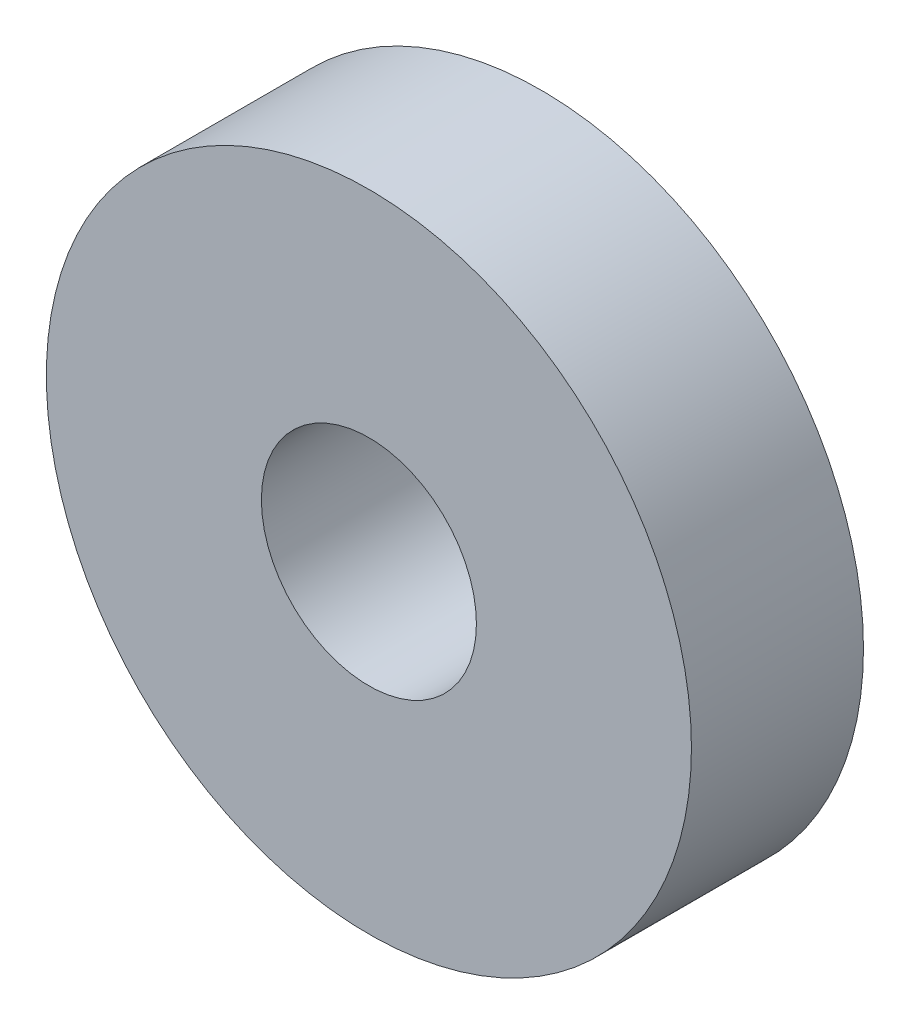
ISO-10303-21;
HEADER;
FILE_DESCRIPTION(('STEP AP214'),'2;1');
FILE_NAME('part.step','',(''),(''),'','','');
FILE_SCHEMA(('AUTOMOTIVE_DESIGN { 1 0 10303 214 1 1 1 1 }'));
ENDSEC;
DATA;
#1=APPLICATION_CONTEXT('core data for automotive mechanical design processes');
#2=APPLICATION_PROTOCOL_DEFINITION('international standard','automotive_design',2000,#1);
#3=PRODUCT_CONTEXT('',#1,'mechanical');
#4=PRODUCT('Part','Part','',(#3));
#5=PRODUCT_RELATED_PRODUCT_CATEGORY('part','',(#4));
#6=PRODUCT_DEFINITION_FORMATION('','',#4);
#7=PRODUCT_DEFINITION_CONTEXT('part definition',#1,'design');
#8=PRODUCT_DEFINITION('design','',#6,#7);
#9=PRODUCT_DEFINITION_SHAPE('','',#8);
#10=(LENGTH_UNIT() NAMED_UNIT(*) SI_UNIT(.MILLI.,.METRE.));
#11=(NAMED_UNIT(*) PLANE_ANGLE_UNIT() SI_UNIT($,.RADIAN.));
#12=(NAMED_UNIT(*) SI_UNIT($,.STERADIAN.) SOLID_ANGLE_UNIT());
#13=UNCERTAINTY_MEASURE_WITH_UNIT(LENGTH_MEASURE(1.E-05),#10,'distance_accuracy_value','');
#14=(GEOMETRIC_REPRESENTATION_CONTEXT(3) GLOBAL_UNCERTAINTY_ASSIGNED_CONTEXT((#13)) GLOBAL_UNIT_ASSIGNED_CONTEXT((#10,
#11,#12)) REPRESENTATION_CONTEXT('',''));
#15=CARTESIAN_POINT('',(0.,0.,0.));
#16=DIRECTION('',(0.,0.,1.));
#17=DIRECTION('',(1.,0.,0.));
#18=AXIS2_PLACEMENT_3D('',#15,#16,#17);
#19=CARTESIAN_POINT('',(0.,0.,0.));
#20=DIRECTION('',(0.,0.,-1.));
#21=DIRECTION('',(-1.,0.,0.));
#22=AXIS2_PLACEMENT_3D('',#19,#20,#21);
#23=PLANE('',#22);
#24=CARTESIAN_POINT('',(0.,0.,0.));
#25=DIRECTION('',(0.,0.,1.));
#26=DIRECTION('',(1.,0.,0.));
#27=AXIS2_PLACEMENT_3D('',#24,#25,#26);
#28=CIRCLE('',#27,15.);
#29=CARTESIAN_POINT('',(15.,0.,0.));
#30=VERTEX_POINT('',#29);
#31=EDGE_CURVE('E27',#30,#30,#28,.T.);
#32=ORIENTED_EDGE('',*,*,#31,.F.);
#33=EDGE_LOOP('',(#32));
#34=FACE_BOUND('',#33,.T.);
#35=CARTESIAN_POINT('',(0.,0.,0.));
#36=DIRECTION('',(0.,0.,1.));
#37=DIRECTION('',(1.,0.,0.));
#38=AXIS2_PLACEMENT_3D('',#35,#36,#37);
#39=CIRCLE('',#38,5.);
#40=CARTESIAN_POINT('',(5.,0.,0.));
#41=VERTEX_POINT('',#40);
#42=EDGE_CURVE('E18',#41,#41,#39,.T.);
#43=ORIENTED_EDGE('',*,*,#42,.T.);
#44=EDGE_LOOP('',(#43));
#45=FACE_BOUND('',#44,.T.);
#46=ADVANCED_FACE('F14',(#34,#45),#23,.T.);
#47=CARTESIAN_POINT('',(0.,0.,0.));
#48=DIRECTION('',(0.,0.,1.));
#49=DIRECTION('',(1.,0.,0.));
#50=AXIS2_PLACEMENT_3D('',#47,#48,#49);
#51=CYLINDRICAL_SURFACE('',#50,5.);
#52=CARTESIAN_POINT('',(0.,0.,8.));
#53=DIRECTION('',(0.,0.,1.));
#54=DIRECTION('',(1.,0.,0.));
#55=AXIS2_PLACEMENT_3D('',#52,#53,#54);
#56=CIRCLE('',#55,5.);
#57=CARTESIAN_POINT('',(5.,0.,8.));
#58=VERTEX_POINT('',#57);
#59=EDGE_CURVE('E22',#58,#58,#56,.T.);
#60=ORIENTED_EDGE('',*,*,#59,.T.);
#61=EDGE_LOOP('',(#60));
#62=FACE_BOUND('',#61,.T.);
#63=ORIENTED_EDGE('',*,*,#42,.F.);
#64=EDGE_LOOP('',(#63));
#65=FACE_BOUND('',#64,.T.);
#66=ADVANCED_FACE('F36',(#62,#65),#51,.F.);
#67=CARTESIAN_POINT('',(0.,0.,0.));
#68=DIRECTION('',(0.,0.,1.));
#69=DIRECTION('',(1.,0.,0.));
#70=AXIS2_PLACEMENT_3D('',#67,#68,#69);
#71=CYLINDRICAL_SURFACE('',#70,15.);
#72=ORIENTED_EDGE('',*,*,#31,.T.);
#73=EDGE_LOOP('',(#72));
#74=FACE_BOUND('',#73,.T.);
#75=CARTESIAN_POINT('',(0.,0.,8.));
#76=DIRECTION('',(0.,0.,1.));
#77=DIRECTION('',(1.,0.,0.));
#78=AXIS2_PLACEMENT_3D('',#75,#76,#77);
#79=CIRCLE('',#78,15.);
#80=CARTESIAN_POINT('',(15.,0.,8.));
#81=VERTEX_POINT('',#80);
#82=EDGE_CURVE('E9',#81,#81,#79,.F.);
#83=ORIENTED_EDGE('',*,*,#82,.T.);
#84=EDGE_LOOP('',(#83));
#85=FACE_BOUND('',#84,.T.);
#86=ADVANCED_FACE('F38',(#74,#85),#71,.T.);
#87=CARTESIAN_POINT('',(0.,0.,8.));
#88=DIRECTION('',(0.,0.,-1.));
#89=DIRECTION('',(-1.,0.,0.));
#90=AXIS2_PLACEMENT_3D('',#87,#88,#89);
#91=PLANE('',#90);
#92=ORIENTED_EDGE('',*,*,#82,.F.);
#93=EDGE_LOOP('',(#92));
#94=FACE_BOUND('',#93,.T.);
#95=ORIENTED_EDGE('',*,*,#59,.F.);
#96=EDGE_LOOP('',(#95));
#97=FACE_BOUND('',#96,.T.);
#98=ADVANCED_FACE('F16',(#94,#97),#91,.F.);
#99=CLOSED_SHELL('',(#46,#66,#86,#98));
#100=MANIFOLD_SOLID_BREP('B1',#99);
#101=ADVANCED_BREP_SHAPE_REPRESENTATION('',(#18,#100),#14);
#102=SHAPE_DEFINITION_REPRESENTATION(#9,#101);
ENDSEC;
END-ISO-10303-21;
